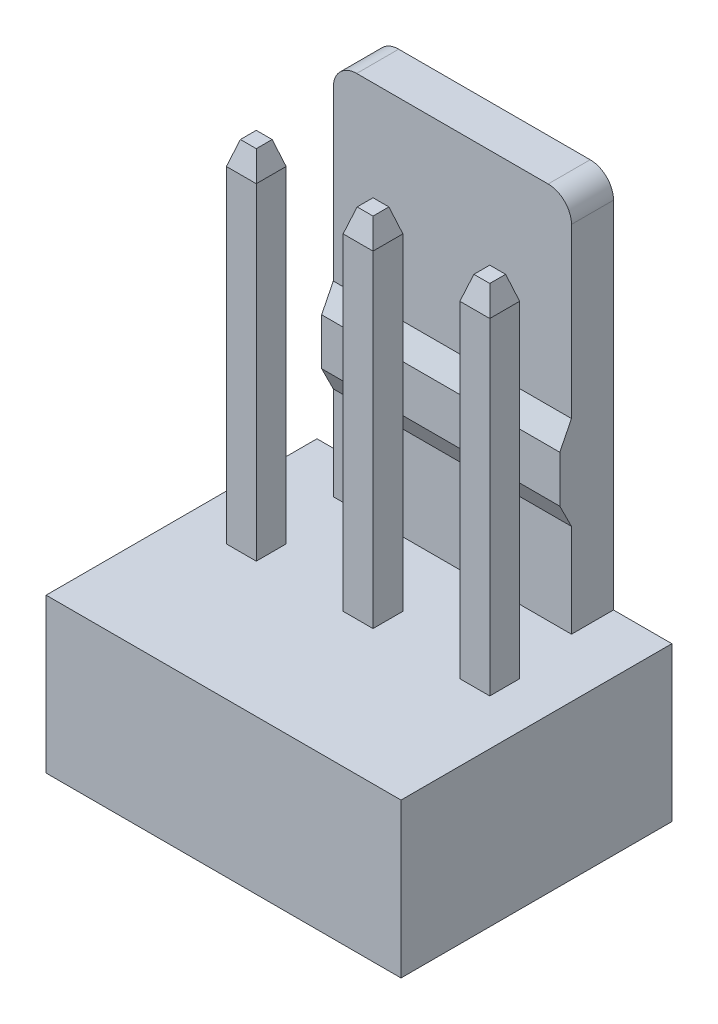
from build123d import *
from OCP.BRepFilletAPI import BRepFilletAPI_MakeChamfer

# Parameters (mm, degrees)
BASE_EXTRUDE_DEPTH  = 3.8
SKETCH2_W           = 1.25
SKETCH2_H           = 8.1
CUT_EXTRUDE1_DEPTH  = 14.343163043
FILLET1_R           = 0.5
SKETCH3_W           = 0.64
SKETCH3_H           = 0.64
BOSS_EXTRUDE1_DEPTH = 10.8
SKETCH3_2_W         = 0.64
SKETCH3_2_H         = 0.64
CUT_EXTRUDE2_DEPTH  = 2
CHAMFER1_SIZE       = 0.5
CHAMFER1_SIZE2      = 0.15


with BuildPart() as part:
    # Sketch1 → Base-Extrude (new, symmetric)
    with BuildSketch(Plane(origin=(0, 0, 0), x_dir=(0, 0, -1), z_dir=(1, 0, 0))):
        Polygon((2.6, 0), (2.6, 11.4), (1.7, 11.4), (1.7, 7.3), (1.45, 6.8), (1.45, 5.8), (1.7, 5.3), (1.7, 3.3), (-3.2, 3.3), (-3.2, 0), align=None)
    extrude(amount=BASE_EXTRUDE_DEPTH, both=True)

    # Sketch2 → Cut-Extrude1 (cut, through all)
    with BuildSketch(Plane(origin=(0, 0, -2.6), x_dir=(-1, 0, 0), z_dir=(0, 0, -1))):
        with Locations((3.175, 7.35)):
            Rectangle(SKETCH2_W, SKETCH2_H)
        with Locations((-3.175, 7.35)):
            Rectangle(SKETCH2_W, SKETCH2_H)
    extrude(amount=-CUT_EXTRUDE1_DEPTH, mode=Mode.SUBTRACT)

    # Fillet1
    fillet1_edges = [part.edges().sort_by_distance(p)[0] for p in [
        (-2.55, 11.4, -2.15),
        (2.55, 11.4, -2.15),
    ]]
    fillet(fillet1_edges, radius=FILLET1_R)

    # Sketch3 → Boss-Extrude1 (add)
    with BuildSketch(Plane(origin=(0, 0, 0), x_dir=(-1, 0, 0), z_dir=(0, 1, 0))):
        with Locations((2.5, 0)):
            Rectangle(SKETCH3_W, SKETCH3_H)
        Rectangle(SKETCH3_W, SKETCH3_H)
        with Locations((-2.5, 0)):
            Rectangle(SKETCH3_W, SKETCH3_H)
    extrude(amount=BOSS_EXTRUDE1_DEPTH)

    # Sketch3_2 → Cut-Extrude2 (cut)
    with BuildSketch(Plane(origin=(0, 0, 0), x_dir=(-1, 0, 0), z_dir=(0, 1, 0))):
        with Locations((2.5, 0)):
            Rectangle(SKETCH3_2_W, SKETCH3_2_H)
        Rectangle(SKETCH3_2_W, SKETCH3_2_H)
        with Locations((-2.5, 0)):
            Rectangle(SKETCH3_2_W, SKETCH3_2_H)
    extrude(amount=CUT_EXTRUDE2_DEPTH, mode=Mode.SUBTRACT)

    # Chamfer1: one chamfer whose edges measure the first distance from different faces: ONE call of the kernel's chamfer builder (chamfer() names one face for all edges)
    chamfer1_edges_1 = [part.edges().sort_by_distance(p)[0] for p in [
        (0.32, 10.8, 0),
    ]]
    chamfer1_side_1 = [part.faces().sort_by_distance(p)[0] for p in [
        (0.32, 7.05, 0),
    ]]
    chamfer1_edges_2 = [part.edges().sort_by_distance(p)[0] for p in [
        (0, 10.8, -0.32),
    ]]
    chamfer1_side_2 = [part.faces().sort_by_distance(p)[0] for p in [
        (0, 7.05, -0.32),
    ]]
    chamfer1_edges_3 = [part.edges().sort_by_distance(p)[0] for p in [
        (-0.32, 10.8, 0),
    ]]
    chamfer1_side_3 = [part.faces().sort_by_distance(p)[0] for p in [
        (-0.32, 7.05, 0),
    ]]
    chamfer1_edges_4 = [part.edges().sort_by_distance(p)[0] for p in [
        (0, 10.8, 0.32),
    ]]
    chamfer1_side_4 = [part.faces().sort_by_distance(p)[0] for p in [
        (0, 7.05, 0.32),
    ]]
    chamfer1_edges_5 = [part.edges().sort_by_distance(p)[0] for p in [
        (2.18, 10.8, 0),
    ]]
    chamfer1_side_5 = [part.faces().sort_by_distance(p)[0] for p in [
        (2.18, 7.05, 0),
    ]]
    chamfer1_edges_6 = [part.edges().sort_by_distance(p)[0] for p in [
        (2.5, 10.8, 0.32),
    ]]
    chamfer1_side_6 = [part.faces().sort_by_distance(p)[0] for p in [
        (2.5, 7.05, 0.32),
    ]]
    chamfer1_edges_7 = [part.edges().sort_by_distance(p)[0] for p in [
        (2.82, 10.8, 0),
    ]]
    chamfer1_side_7 = [part.faces().sort_by_distance(p)[0] for p in [
        (2.82, 7.05, 0),
    ]]
    chamfer1_edges_8 = [part.edges().sort_by_distance(p)[0] for p in [
        (2.5, 10.8, -0.32),
    ]]
    chamfer1_side_8 = [part.faces().sort_by_distance(p)[0] for p in [
        (2.5, 7.05, -0.32),
    ]]
    chamfer1_edges_9 = [part.edges().sort_by_distance(p)[0] for p in [
        (-2.82, 10.8, 0),
    ]]
    chamfer1_side_9 = [part.faces().sort_by_distance(p)[0] for p in [
        (-2.82, 7.05, 0),
    ]]
    chamfer1_edges_10 = [part.edges().sort_by_distance(p)[0] for p in [
        (-2.5, 10.8, 0.32),
    ]]
    chamfer1_side_10 = [part.faces().sort_by_distance(p)[0] for p in [
        (-2.5, 7.05, 0.32),
    ]]
    chamfer1_edges_11 = [part.edges().sort_by_distance(p)[0] for p in [
        (-2.18, 10.8, 0),
    ]]
    chamfer1_side_11 = [part.faces().sort_by_distance(p)[0] for p in [
        (-2.18, 7.05, 0),
    ]]
    chamfer1_edges_12 = [part.edges().sort_by_distance(p)[0] for p in [
        (-2.5, 10.8, -0.32),
    ]]
    chamfer1_side_12 = [part.faces().sort_by_distance(p)[0] for p in [
        (-2.5, 7.05, -0.32),
    ]]
    chamfer1 = BRepFilletAPI_MakeChamfer(part.part.solid().wrapped)
    for e in chamfer1_edges_1:
        chamfer1.Add(CHAMFER1_SIZE, CHAMFER1_SIZE2, e.wrapped, chamfer1_side_1[0].wrapped)  # the first distance lies on this face
    for e in chamfer1_edges_2:
        chamfer1.Add(CHAMFER1_SIZE, CHAMFER1_SIZE2, e.wrapped, chamfer1_side_2[0].wrapped)  # the first distance lies on this face
    for e in chamfer1_edges_3:
        chamfer1.Add(CHAMFER1_SIZE, CHAMFER1_SIZE2, e.wrapped, chamfer1_side_3[0].wrapped)  # the first distance lies on this face
    for e in chamfer1_edges_4:
        chamfer1.Add(CHAMFER1_SIZE, CHAMFER1_SIZE2, e.wrapped, chamfer1_side_4[0].wrapped)  # the first distance lies on this face
    for e in chamfer1_edges_5:
        chamfer1.Add(CHAMFER1_SIZE, CHAMFER1_SIZE2, e.wrapped, chamfer1_side_5[0].wrapped)  # the first distance lies on this face
    for e in chamfer1_edges_6:
        chamfer1.Add(CHAMFER1_SIZE, CHAMFER1_SIZE2, e.wrapped, chamfer1_side_6[0].wrapped)  # the first distance lies on this face
    for e in chamfer1_edges_7:
        chamfer1.Add(CHAMFER1_SIZE, CHAMFER1_SIZE2, e.wrapped, chamfer1_side_7[0].wrapped)  # the first distance lies on this face
    for e in chamfer1_edges_8:
        chamfer1.Add(CHAMFER1_SIZE, CHAMFER1_SIZE2, e.wrapped, chamfer1_side_8[0].wrapped)  # the first distance lies on this face
    for e in chamfer1_edges_9:
        chamfer1.Add(CHAMFER1_SIZE, CHAMFER1_SIZE2, e.wrapped, chamfer1_side_9[0].wrapped)  # the first distance lies on this face
    for e in chamfer1_edges_10:
        chamfer1.Add(CHAMFER1_SIZE, CHAMFER1_SIZE2, e.wrapped, chamfer1_side_10[0].wrapped)  # the first distance lies on this face
    for e in chamfer1_edges_11:
        chamfer1.Add(CHAMFER1_SIZE, CHAMFER1_SIZE2, e.wrapped, chamfer1_side_11[0].wrapped)  # the first distance lies on this face
    for e in chamfer1_edges_12:
        chamfer1.Add(CHAMFER1_SIZE, CHAMFER1_SIZE2, e.wrapped, chamfer1_side_12[0].wrapped)  # the first distance lies on this face
    add(Compound.cast(chamfer1.Shape()), mode=Mode.REPLACE)


solid = part.part
